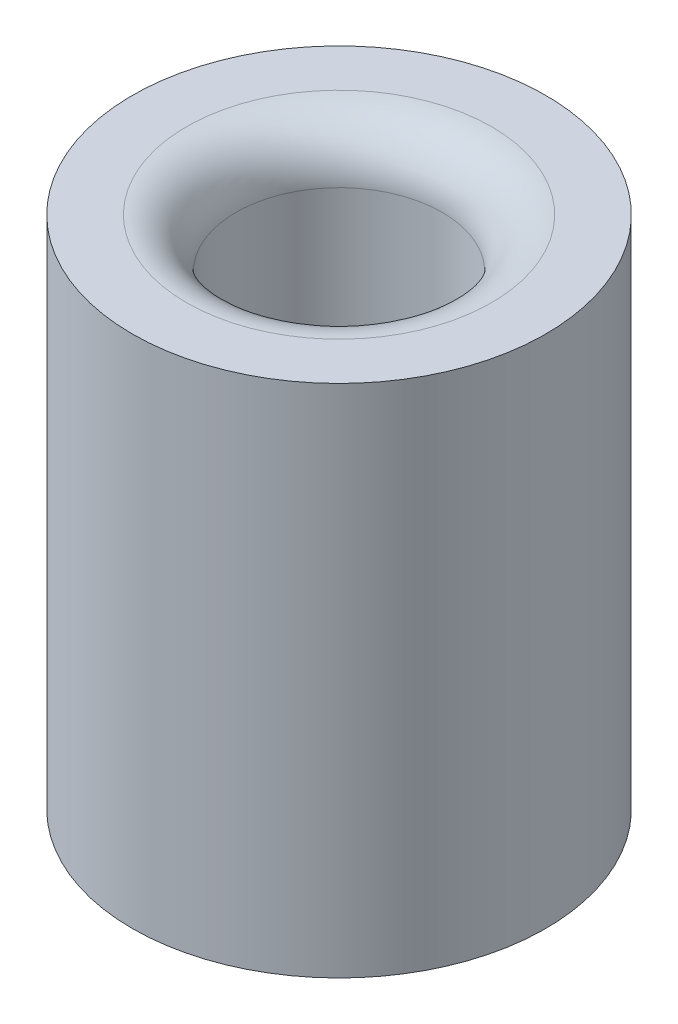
from build123d import *

# Parameters (mm, degrees)
SKETCH1_W = 1.59766
SKETCH1_H = 7.9375
FILLET1_R = 0.762


with BuildPart() as part:
    # Sketch1 → Revolve1 (revolve)
    with BuildSketch(Plane(origin=(0, 0, 0), x_dir=(0, 0, -1), z_dir=(1, 0, 0)), mode=Mode.PRIVATE) as revolve1_sk:
        with Locations((2.3876, -3.96875)):
            Rectangle(SKETCH1_W, SKETCH1_H)
    revolve(revolve1_sk.sketch.rotate(Axis((0, 0, 0), (0, -1, 0)), 180), axis=Axis((0, 0, 0), (0, -1, 0)))

    # Fillet1
    fillet1_edges = [part.edges().sort_by_distance(p)[0] for p in [
        (0, 0, -1.58877),
    ]]
    fillet(fillet1_edges, radius=FILLET1_R)


solid = part.part
